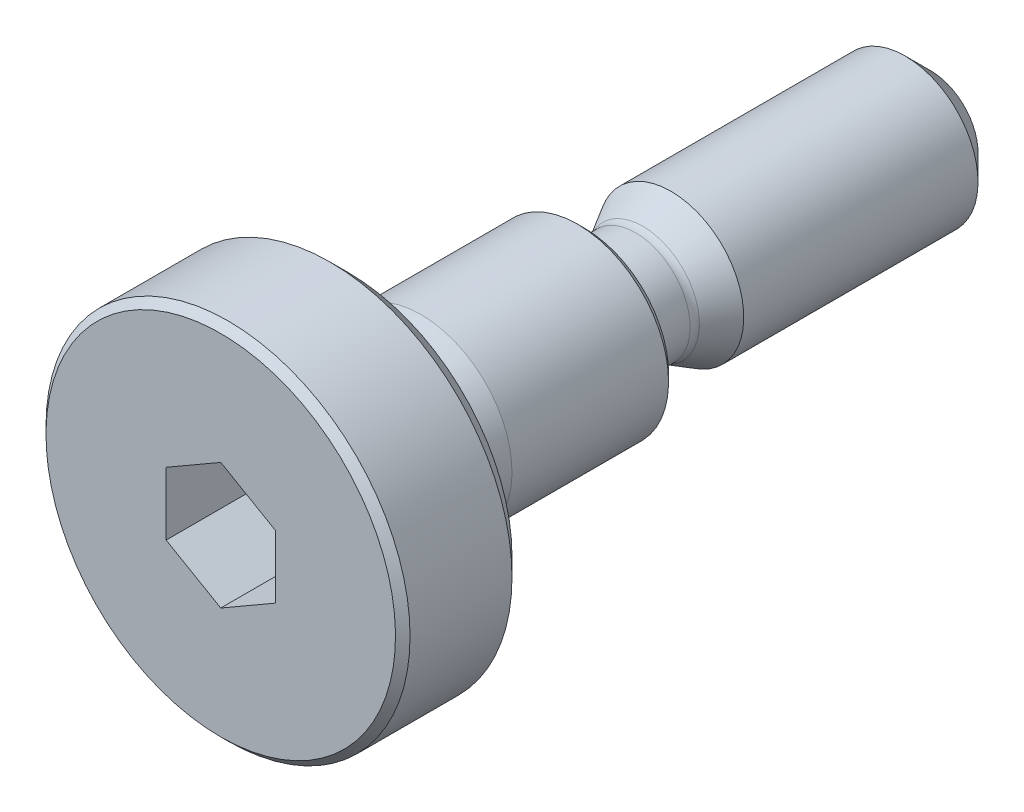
ISO-10303-21;
HEADER;
FILE_DESCRIPTION(('STEP AP214'),'2;1');
FILE_NAME('part.step','',(''),(''),'','','');
FILE_SCHEMA(('AUTOMOTIVE_DESIGN { 1 0 10303 214 1 1 1 1 }'));
ENDSEC;
DATA;
#1=APPLICATION_CONTEXT('core data for automotive mechanical design processes');
#2=APPLICATION_PROTOCOL_DEFINITION('international standard','automotive_design',2000,#1);
#3=PRODUCT_CONTEXT('',#1,'mechanical');
#4=PRODUCT('Part','Part','',(#3));
#5=PRODUCT_RELATED_PRODUCT_CATEGORY('part','',(#4));
#6=PRODUCT_DEFINITION_FORMATION('','',#4);
#7=PRODUCT_DEFINITION_CONTEXT('part definition',#1,'design');
#8=PRODUCT_DEFINITION('design','',#6,#7);
#9=PRODUCT_DEFINITION_SHAPE('','',#8);
#10=(LENGTH_UNIT() NAMED_UNIT(*) SI_UNIT(.MILLI.,.METRE.));
#11=(NAMED_UNIT(*) PLANE_ANGLE_UNIT() SI_UNIT($,.RADIAN.));
#12=(NAMED_UNIT(*) SI_UNIT($,.STERADIAN.) SOLID_ANGLE_UNIT());
#13=UNCERTAINTY_MEASURE_WITH_UNIT(LENGTH_MEASURE(1.E-05),#10,'distance_accuracy_value','');
#14=(GEOMETRIC_REPRESENTATION_CONTEXT(3) GLOBAL_UNCERTAINTY_ASSIGNED_CONTEXT((#13)) GLOBAL_UNIT_ASSIGNED_CONTEXT((#10,
#11,#12)) REPRESENTATION_CONTEXT('',''));
#15=CARTESIAN_POINT('',(0.,0.,0.));
#16=DIRECTION('',(0.,0.,1.));
#17=DIRECTION('',(1.,0.,0.));
#18=AXIS2_PLACEMENT_3D('',#15,#16,#17);
#19=CARTESIAN_POINT('',(0.,0.,10.));
#20=DIRECTION('',(0.,0.,1.));
#21=DIRECTION('',(0.,-1.,0.));
#22=AXIS2_PLACEMENT_3D('',#19,#20,#21);
#23=PLANE('',#22);
#24=DIRECTION('',(-0.866025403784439,0.5,0.));
#25=VECTOR('',#24,1.);
#26=CARTESIAN_POINT('',(1.5,0.86602540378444,10.));
#27=LINE('',#26,#25);
#28=CARTESIAN_POINT('',(1.5,0.86602540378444,10.));
#29=VERTEX_POINT('',#28);
#30=CARTESIAN_POINT('',(0.,1.73205080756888,10.));
#31=VERTEX_POINT('',#30);
#32=EDGE_CURVE('E29',#29,#31,#27,.T.);
#33=ORIENTED_EDGE('',*,*,#32,.F.);
#34=DIRECTION('',(0.,1.,0.));
#35=VECTOR('',#34,1.);
#36=CARTESIAN_POINT('',(1.5,-0.866025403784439,10.));
#37=LINE('',#36,#35);
#38=CARTESIAN_POINT('',(1.5,-0.866025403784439,10.));
#39=VERTEX_POINT('',#38);
#40=EDGE_CURVE('E112',#39,#29,#37,.T.);
#41=ORIENTED_EDGE('',*,*,#40,.F.);
#42=DIRECTION('',(0.866025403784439,0.5,0.));
#43=VECTOR('',#42,1.);
#44=CARTESIAN_POINT('',(0.,-1.73205080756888,10.));
#45=LINE('',#44,#43);
#46=CARTESIAN_POINT('',(0.,-1.73205080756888,10.));
#47=VERTEX_POINT('',#46);
#48=EDGE_CURVE('E110',#47,#39,#45,.T.);
#49=ORIENTED_EDGE('',*,*,#48,.F.);
#50=DIRECTION('',(0.866025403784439,-0.5,0.));
#51=VECTOR('',#50,1.);
#52=CARTESIAN_POINT('',(-1.5,-0.866025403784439,10.));
#53=LINE('',#52,#51);
#54=CARTESIAN_POINT('',(-1.5,-0.866025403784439,10.));
#55=VERTEX_POINT('',#54);
#56=EDGE_CURVE('E77',#55,#47,#53,.T.);
#57=ORIENTED_EDGE('',*,*,#56,.F.);
#58=DIRECTION('',(0.,-1.,0.));
#59=VECTOR('',#58,1.);
#60=CARTESIAN_POINT('',(-1.5,0.866025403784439,10.));
#61=LINE('',#60,#59);
#62=CARTESIAN_POINT('',(-1.5,0.866025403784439,10.));
#63=VERTEX_POINT('',#62);
#64=EDGE_CURVE('E106',#63,#55,#61,.T.);
#65=ORIENTED_EDGE('',*,*,#64,.F.);
#66=DIRECTION('',(-0.866025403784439,-0.5,0.));
#67=VECTOR('',#66,1.);
#68=CARTESIAN_POINT('',(0.,1.73205080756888,10.));
#69=LINE('',#68,#67);
#70=EDGE_CURVE('E103',#31,#63,#69,.T.);
#71=ORIENTED_EDGE('',*,*,#70,.F.);
#72=EDGE_LOOP('',(#33,#41,#49,#57,#65,#71));
#73=FACE_BOUND('',#72,.T.);
#74=CARTESIAN_POINT('',(0.,0.,10.));
#75=DIRECTION('',(0.,0.,1.));
#76=DIRECTION('',(0.,-1.,0.));
#77=AXIS2_PLACEMENT_3D('',#74,#75,#76);
#78=CIRCLE('',#77,4.8);
#79=CARTESIAN_POINT('',(0.,-4.8,10.));
#80=VERTEX_POINT('',#79);
#81=EDGE_CURVE('E151',#80,#80,#78,.T.);
#82=ORIENTED_EDGE('',*,*,#81,.T.);
#83=EDGE_LOOP('',(#82));
#84=FACE_BOUND('',#83,.T.);
#85=ADVANCED_FACE('F14',(#73,#84),#23,.T.);
#86=CARTESIAN_POINT('',(0.,0.,-9.5));
#87=DIRECTION('',(0.,0.,-1.));
#88=DIRECTION('',(0.,1.,0.));
#89=AXIS2_PLACEMENT_3D('',#86,#87,#88);
#90=CYLINDRICAL_SURFACE('',#89,5.);
#91=CARTESIAN_POINT('',(0.,0.,7.));
#92=DIRECTION('',(0.,0.,-1.));
#93=DIRECTION('',(0.,1.,0.));
#94=AXIS2_PLACEMENT_3D('',#91,#92,#93);
#95=CIRCLE('',#94,5.);
#96=CARTESIAN_POINT('',(0.,5.,7.));
#97=VERTEX_POINT('',#96);
#98=EDGE_CURVE('E157',#97,#97,#95,.F.);
#99=ORIENTED_EDGE('',*,*,#98,.T.);
#100=EDGE_LOOP('',(#99));
#101=FACE_BOUND('',#100,.T.);
#102=CARTESIAN_POINT('',(0.,0.,9.8));
#103=DIRECTION('',(0.,0.,1.));
#104=DIRECTION('',(0.,-1.,0.));
#105=AXIS2_PLACEMENT_3D('',#102,#103,#104);
#106=CIRCLE('',#105,5.);
#107=CARTESIAN_POINT('',(0.,-5.,9.8));
#108=VERTEX_POINT('',#107);
#109=EDGE_CURVE('E148',#108,#108,#106,.F.);
#110=ORIENTED_EDGE('',*,*,#109,.T.);
#111=EDGE_LOOP('',(#110));
#112=FACE_BOUND('',#111,.T.);
#113=ADVANCED_FACE('F181',(#101,#112),#90,.T.);
#114=CARTESIAN_POINT('',(0.,5.,6.5));
#115=DIRECTION('',(0.,0.,-1.));
#116=DIRECTION('',(0.,1.,0.));
#117=AXIS2_PLACEMENT_3D('',#114,#115,#116);
#118=PLANE('',#117);
#119=CARTESIAN_POINT('',(0.,0.,6.5));
#120=DIRECTION('',(0.,0.,-1.));
#121=DIRECTION('',(0.,1.,0.));
#122=AXIS2_PLACEMENT_3D('',#119,#120,#121);
#123=CIRCLE('',#122,4.5);
#124=CARTESIAN_POINT('',(0.,4.5,6.5));
#125=VERTEX_POINT('',#124);
#126=EDGE_CURVE('E154',#125,#125,#123,.T.);
#127=ORIENTED_EDGE('',*,*,#126,.T.);
#128=EDGE_LOOP('',(#127));
#129=FACE_BOUND('',#128,.T.);
#130=CARTESIAN_POINT('',(0.,0.,6.5));
#131=DIRECTION('',(0.,0.,-1.));
#132=DIRECTION('',(0.,1.,0.));
#133=AXIS2_PLACEMENT_3D('',#130,#131,#132);
#134=CIRCLE('',#133,2.7);
#135=CARTESIAN_POINT('',(0.,2.7,6.5));
#136=VERTEX_POINT('',#135);
#137=EDGE_CURVE('E133',#136,#136,#134,.F.);
#138=ORIENTED_EDGE('',*,*,#137,.T.);
#139=EDGE_LOOP('',(#138));
#140=FACE_BOUND('',#139,.T.);
#141=ADVANCED_FACE('F188',(#129,#140),#118,.T.);
#142=CARTESIAN_POINT('',(0.,0.,-9.5));
#143=DIRECTION('',(0.,0.,-1.));
#144=DIRECTION('',(0.,1.,0.));
#145=AXIS2_PLACEMENT_3D('',#142,#143,#144);
#146=CYLINDRICAL_SURFACE('',#145,2.3);
#147=CARTESIAN_POINT('',(0.,0.,6.1));
#148=DIRECTION('',(0.,0.,-1.));
#149=DIRECTION('',(0.,1.,0.));
#150=AXIS2_PLACEMENT_3D('',#147,#148,#149);
#151=CIRCLE('',#150,2.3);
#152=CARTESIAN_POINT('',(0.,2.3,6.1));
#153=VERTEX_POINT('',#152);
#154=EDGE_CURVE('E130',#153,#153,#151,.T.);
#155=ORIENTED_EDGE('',*,*,#154,.T.);
#156=EDGE_LOOP('',(#155));
#157=FACE_BOUND('',#156,.T.);
#158=CARTESIAN_POINT('',(0.,0.,5.5));
#159=DIRECTION('',(0.,0.,-1.));
#160=DIRECTION('',(0.,1.,0.));
#161=AXIS2_PLACEMENT_3D('',#158,#159,#160);
#162=CIRCLE('',#161,2.3);
#163=CARTESIAN_POINT('',(0.,2.3,5.5));
#164=VERTEX_POINT('',#163);
#165=EDGE_CURVE('E127',#164,#164,#162,.T.);
#166=ORIENTED_EDGE('',*,*,#165,.F.);
#167=EDGE_LOOP('',(#166));
#168=FACE_BOUND('',#167,.T.);
#169=ADVANCED_FACE('F256',(#157,#168),#146,.T.);
#170=CARTESIAN_POINT('',(0.,0.,4.5));
#171=DIRECTION('',(0.,0.,-1.));
#172=DIRECTION('',(0.,1.,0.));
#173=AXIS2_PLACEMENT_3D('',#170,#171,#172);
#174=CONICAL_SURFACE('',#173,2.5,0.197395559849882);
#175=ORIENTED_EDGE('',*,*,#165,.T.);
#176=EDGE_LOOP('',(#175));
#177=FACE_BOUND('',#176,.T.);
#178=CARTESIAN_POINT('',(0.,0.,4.5));
#179=DIRECTION('',(0.,0.,-1.));
#180=DIRECTION('',(0.,1.,0.));
#181=AXIS2_PLACEMENT_3D('',#178,#179,#180);
#182=CIRCLE('',#181,2.5);
#183=CARTESIAN_POINT('',(0.,2.5,4.5));
#184=VERTEX_POINT('',#183);
#185=EDGE_CURVE('E124',#184,#184,#182,.T.);
#186=ORIENTED_EDGE('',*,*,#185,.F.);
#187=EDGE_LOOP('',(#186));
#188=FACE_BOUND('',#187,.T.);
#189=ADVANCED_FACE('F252',(#177,#188),#174,.T.);
#190=CARTESIAN_POINT('',(0.,0.,-9.5));
#191=DIRECTION('',(0.,0.,-1.));
#192=DIRECTION('',(0.,1.,0.));
#193=AXIS2_PLACEMENT_3D('',#190,#191,#192);
#194=CYLINDRICAL_SURFACE('',#193,2.5);
#195=CARTESIAN_POINT('',(0.,0.,0.2));
#196=DIRECTION('',(0.,0.,-1.));
#197=DIRECTION('',(0.,1.,0.));
#198=AXIS2_PLACEMENT_3D('',#195,#196,#197);
#199=CIRCLE('',#198,2.5);
#200=CARTESIAN_POINT('',(0.,2.5,0.2));
#201=VERTEX_POINT('',#200);
#202=EDGE_CURVE('E163',#201,#201,#199,.F.);
#203=ORIENTED_EDGE('',*,*,#202,.T.);
#204=EDGE_LOOP('',(#203));
#205=FACE_BOUND('',#204,.T.);
#206=ORIENTED_EDGE('',*,*,#185,.T.);
#207=EDGE_LOOP('',(#206));
#208=FACE_BOUND('',#207,.T.);
#209=ADVANCED_FACE('F231',(#205,#208),#194,.T.);
#210=CARTESIAN_POINT('',(0.,2.5,0.));
#211=DIRECTION('',(0.,0.,-1.));
#212=DIRECTION('',(0.,1.,0.));
#213=AXIS2_PLACEMENT_3D('',#210,#211,#212);
#214=PLANE('',#213);
#215=CARTESIAN_POINT('',(0.,0.,0.));
#216=DIRECTION('',(0.,0.,-1.));
#217=DIRECTION('',(0.,1.,0.));
#218=AXIS2_PLACEMENT_3D('',#215,#216,#217);
#219=CIRCLE('',#218,2.3);
#220=CARTESIAN_POINT('',(0.,2.3,0.));
#221=VERTEX_POINT('',#220);
#222=EDGE_CURVE('E160',#221,#221,#219,.T.);
#223=ORIENTED_EDGE('',*,*,#222,.T.);
#224=EDGE_LOOP('',(#223));
#225=FACE_BOUND('',#224,.T.);
#226=CARTESIAN_POINT('',(0.,0.,0.));
#227=DIRECTION('',(0.,0.,-1.));
#228=DIRECTION('',(0.,1.,0.));
#229=AXIS2_PLACEMENT_3D('',#226,#227,#228);
#230=CIRCLE('',#229,1.9);
#231=CARTESIAN_POINT('',(0.,1.9,0.));
#232=VERTEX_POINT('',#231);
#233=EDGE_CURVE('E145',#232,#232,#230,.F.);
#234=ORIENTED_EDGE('',*,*,#233,.T.);
#235=EDGE_LOOP('',(#234));
#236=FACE_BOUND('',#235,.T.);
#237=ADVANCED_FACE('F227',(#225,#236),#214,.T.);
#238=CARTESIAN_POINT('',(0.,0.,-9.5));
#239=DIRECTION('',(0.,0.,-1.));
#240=DIRECTION('',(0.,1.,0.));
#241=AXIS2_PLACEMENT_3D('',#238,#239,#240);
#242=CYLINDRICAL_SURFACE('',#241,1.5);
#243=CARTESIAN_POINT('',(0.,0.,-1.39282032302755));
#244=DIRECTION('',(0.,0.,-1.));
#245=DIRECTION('',(0.,1.,0.));
#246=AXIS2_PLACEMENT_3D('',#243,#244,#245);
#247=CIRCLE('',#246,1.5);
#248=CARTESIAN_POINT('',(0.,1.5,-1.39282032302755));
#249=VERTEX_POINT('',#248);
#250=EDGE_CURVE('E142',#249,#249,#247,.F.);
#251=ORIENTED_EDGE('',*,*,#250,.T.);
#252=EDGE_LOOP('',(#251));
#253=FACE_BOUND('',#252,.T.);
#254=CARTESIAN_POINT('',(0.,0.,-0.4));
#255=DIRECTION('',(0.,0.,-1.));
#256=DIRECTION('',(0.,1.,0.));
#257=AXIS2_PLACEMENT_3D('',#254,#255,#256);
#258=CIRCLE('',#257,1.5);
#259=CARTESIAN_POINT('',(0.,1.5,-0.4));
#260=VERTEX_POINT('',#259);
#261=EDGE_CURVE('E139',#260,#260,#258,.T.);
#262=ORIENTED_EDGE('',*,*,#261,.T.);
#263=EDGE_LOOP('',(#262));
#264=FACE_BOUND('',#263,.T.);
#265=ADVANCED_FACE('F230',(#253,#264),#242,.T.);
#266=CARTESIAN_POINT('',(0.,0.,-2.36602540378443));
#267=DIRECTION('',(0.,0.,-1.));
#268=DIRECTION('',(0.,1.,0.));
#269=AXIS2_PLACEMENT_3D('',#266,#267,#268);
#270=CONICAL_SURFACE('',#269,2.,0.523598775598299);
#271=CARTESIAN_POINT('',(0.,0.,-1.59282032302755));
#272=DIRECTION('',(0.,0.,-1.));
#273=DIRECTION('',(0.,1.,0.));
#274=AXIS2_PLACEMENT_3D('',#271,#272,#273);
#275=CIRCLE('',#274,1.55358983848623);
#276=CARTESIAN_POINT('',(0.,1.55358983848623,-1.59282032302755));
#277=VERTEX_POINT('',#276);
#278=EDGE_CURVE('E136',#277,#277,#275,.T.);
#279=ORIENTED_EDGE('',*,*,#278,.T.);
#280=EDGE_LOOP('',(#279));
#281=FACE_BOUND('',#280,.T.);
#282=CARTESIAN_POINT('',(0.,0.,-2.36602540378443));
#283=DIRECTION('',(0.,0.,-1.));
#284=DIRECTION('',(0.,1.,0.));
#285=AXIS2_PLACEMENT_3D('',#282,#283,#284);
#286=CIRCLE('',#285,2.);
#287=CARTESIAN_POINT('',(0.,2.,-2.36602540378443));
#288=VERTEX_POINT('',#287);
#289=EDGE_CURVE('E116',#288,#288,#286,.T.);
#290=ORIENTED_EDGE('',*,*,#289,.F.);
#291=EDGE_LOOP('',(#290));
#292=FACE_BOUND('',#291,.T.);
#293=ADVANCED_FACE('F238',(#281,#292),#270,.T.);
#294=CARTESIAN_POINT('',(0.,0.,-9.5));
#295=DIRECTION('',(0.,0.,-1.));
#296=DIRECTION('',(0.,1.,0.));
#297=AXIS2_PLACEMENT_3D('',#294,#295,#296);
#298=CYLINDRICAL_SURFACE('',#297,2.);
#299=CARTESIAN_POINT('',(0.,0.,-8.8));
#300=DIRECTION('',(0.,0.,-1.));
#301=DIRECTION('',(0.,1.,0.));
#302=AXIS2_PLACEMENT_3D('',#299,#300,#301);
#303=CIRCLE('',#302,2.);
#304=CARTESIAN_POINT('',(0.,2.,-8.8));
#305=VERTEX_POINT('',#304);
#306=EDGE_CURVE('E9',#305,#305,#303,.F.);
#307=ORIENTED_EDGE('',*,*,#306,.T.);
#308=EDGE_LOOP('',(#307));
#309=FACE_BOUND('',#308,.T.);
#310=ORIENTED_EDGE('',*,*,#289,.T.);
#311=EDGE_LOOP('',(#310));
#312=FACE_BOUND('',#311,.T.);
#313=ADVANCED_FACE('F245',(#309,#312),#298,.T.);
#314=CARTESIAN_POINT('',(0.,2.,-9.5));
#315=DIRECTION('',(0.,0.,-1.));
#316=DIRECTION('',(0.,1.,0.));
#317=AXIS2_PLACEMENT_3D('',#314,#315,#316);
#318=PLANE('',#317);
#319=CARTESIAN_POINT('',(0.,0.,-9.5));
#320=DIRECTION('',(0.,0.,-1.));
#321=DIRECTION('',(0.,1.,0.));
#322=AXIS2_PLACEMENT_3D('',#319,#320,#321);
#323=CIRCLE('',#322,1.3);
#324=CARTESIAN_POINT('',(0.,1.3,-9.5));
#325=VERTEX_POINT('',#324);
#326=EDGE_CURVE('E22',#325,#325,#323,.T.);
#327=ORIENTED_EDGE('',*,*,#326,.T.);
#328=EDGE_LOOP('',(#327));
#329=FACE_BOUND('',#328,.T.);
#330=ADVANCED_FACE('F168',(#329),#318,.T.);
#331=CARTESIAN_POINT('',(0.,0.,6.1));
#332=DIRECTION('',(0.,0.,-1.));
#333=DIRECTION('',(0.,1.,0.));
#334=AXIS2_PLACEMENT_3D('',#331,#332,#333);
#335=TOROIDAL_SURFACE('',#334,2.7,0.4);
#336=ORIENTED_EDGE('',*,*,#137,.F.);
#337=EDGE_LOOP('',(#336));
#338=FACE_BOUND('',#337,.T.);
#339=ORIENTED_EDGE('',*,*,#154,.F.);
#340=EDGE_LOOP('',(#339));
#341=FACE_BOUND('',#340,.T.);
#342=ADVANCED_FACE('F194',(#338,#341),#335,.F.);
#343=CARTESIAN_POINT('',(0.,0.,-1.39282032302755));
#344=DIRECTION('',(0.,0.,-1.));
#345=DIRECTION('',(0.,1.,0.));
#346=AXIS2_PLACEMENT_3D('',#343,#344,#345);
#347=TOROIDAL_SURFACE('',#346,1.9,0.4);
#348=ORIENTED_EDGE('',*,*,#250,.F.);
#349=EDGE_LOOP('',(#348));
#350=FACE_BOUND('',#349,.T.);
#351=ORIENTED_EDGE('',*,*,#278,.F.);
#352=EDGE_LOOP('',(#351));
#353=FACE_BOUND('',#352,.T.);
#354=ADVANCED_FACE('F197',(#350,#353),#347,.F.);
#355=CARTESIAN_POINT('',(0.,0.,-0.4));
#356=DIRECTION('',(0.,0.,-1.));
#357=DIRECTION('',(0.,1.,0.));
#358=AXIS2_PLACEMENT_3D('',#355,#356,#357);
#359=TOROIDAL_SURFACE('',#358,1.9,0.4);
#360=ORIENTED_EDGE('',*,*,#233,.F.);
#361=EDGE_LOOP('',(#360));
#362=FACE_BOUND('',#361,.T.);
#363=ORIENTED_EDGE('',*,*,#261,.F.);
#364=EDGE_LOOP('',(#363));
#365=FACE_BOUND('',#364,.T.);
#366=ADVANCED_FACE('F201',(#362,#365),#359,.F.);
#367=CARTESIAN_POINT('',(0.,0.,9.8));
#368=DIRECTION('',(0.,0.,-1.));
#369=DIRECTION('',(0.,1.,0.));
#370=AXIS2_PLACEMENT_3D('',#367,#368,#369);
#371=CONICAL_SURFACE('',#370,5.,0.785398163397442);
#372=ORIENTED_EDGE('',*,*,#81,.F.);
#373=EDGE_LOOP('',(#372));
#374=FACE_BOUND('',#373,.T.);
#375=ORIENTED_EDGE('',*,*,#109,.F.);
#376=EDGE_LOOP('',(#375));
#377=FACE_BOUND('',#376,.T.);
#378=ADVANCED_FACE('F205',(#374,#377),#371,.T.);
#379=CARTESIAN_POINT('',(0.,0.,6.5));
#380=DIRECTION('',(0.,0.,1.));
#381=DIRECTION('',(0.,-1.,0.));
#382=AXIS2_PLACEMENT_3D('',#379,#380,#381);
#383=CONICAL_SURFACE('',#382,4.5,0.785398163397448);
#384=ORIENTED_EDGE('',*,*,#98,.F.);
#385=EDGE_LOOP('',(#384));
#386=FACE_BOUND('',#385,.T.);
#387=ORIENTED_EDGE('',*,*,#126,.F.);
#388=EDGE_LOOP('',(#387));
#389=FACE_BOUND('',#388,.T.);
#390=ADVANCED_FACE('F209',(#386,#389),#383,.T.);
#391=CARTESIAN_POINT('',(0.,0.,0.));
#392=DIRECTION('',(0.,0.,1.));
#393=DIRECTION('',(0.,-1.,0.));
#394=AXIS2_PLACEMENT_3D('',#391,#392,#393);
#395=CONICAL_SURFACE('',#394,2.3,0.785398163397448);
#396=ORIENTED_EDGE('',*,*,#202,.F.);
#397=EDGE_LOOP('',(#396));
#398=FACE_BOUND('',#397,.T.);
#399=ORIENTED_EDGE('',*,*,#222,.F.);
#400=EDGE_LOOP('',(#399));
#401=FACE_BOUND('',#400,.T.);
#402=ADVANCED_FACE('F212',(#398,#401),#395,.T.);
#403=CARTESIAN_POINT('',(1.5,0.86602540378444,4.5));
#404=DIRECTION('',(0.5,0.866025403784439,0.));
#405=DIRECTION('',(0.866025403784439,-0.5,0.));
#406=AXIS2_PLACEMENT_3D('',#403,#404,#405);
#407=PLANE('',#406);
#408=ORIENTED_EDGE('',*,*,#32,.T.);
#409=DIRECTION('',(0.,0.,1.));
#410=VECTOR('',#409,1.);
#411=CARTESIAN_POINT('',(0.,1.73205080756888,4.5));
#412=LINE('',#411,#410);
#413=CARTESIAN_POINT('',(0.,1.73205080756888,4.5));
#414=VERTEX_POINT('',#413);
#415=EDGE_CURVE('E59',#414,#31,#412,.T.);
#416=ORIENTED_EDGE('',*,*,#415,.F.);
#417=DIRECTION('',(-0.866025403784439,0.5,0.));
#418=VECTOR('',#417,1.);
#419=CARTESIAN_POINT('',(1.5,0.86602540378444,4.5));
#420=LINE('',#419,#418);
#421=CARTESIAN_POINT('',(1.5,0.86602540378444,4.5));
#422=VERTEX_POINT('',#421);
#423=EDGE_CURVE('E114',#422,#414,#420,.T.);
#424=ORIENTED_EDGE('',*,*,#423,.F.);
#425=DIRECTION('',(0.,0.,1.));
#426=VECTOR('',#425,1.);
#427=CARTESIAN_POINT('',(1.5,0.86602540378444,4.5));
#428=LINE('',#427,#426);
#429=EDGE_CURVE('E37',#422,#29,#428,.T.);
#430=ORIENTED_EDGE('',*,*,#429,.T.);
#431=EDGE_LOOP('',(#408,#416,#424,#430));
#432=FACE_BOUND('',#431,.T.);
#433=ADVANCED_FACE('F215',(#432),#407,.F.);
#434=CARTESIAN_POINT('',(1.5,-0.866025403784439,4.5));
#435=DIRECTION('',(1.,0.,0.));
#436=DIRECTION('',(0.,0.,-1.));
#437=AXIS2_PLACEMENT_3D('',#434,#435,#436);
#438=PLANE('',#437);
#439=ORIENTED_EDGE('',*,*,#40,.T.);
#440=ORIENTED_EDGE('',*,*,#429,.F.);
#441=DIRECTION('',(0.,1.,0.));
#442=VECTOR('',#441,1.);
#443=CARTESIAN_POINT('',(1.5,-0.866025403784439,4.5));
#444=LINE('',#443,#442);
#445=CARTESIAN_POINT('',(1.5,-0.866025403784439,4.5));
#446=VERTEX_POINT('',#445);
#447=EDGE_CURVE('E89',#446,#422,#444,.T.);
#448=ORIENTED_EDGE('',*,*,#447,.F.);
#449=DIRECTION('',(0.,0.,1.));
#450=VECTOR('',#449,1.);
#451=CARTESIAN_POINT('',(1.5,-0.866025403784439,4.5));
#452=LINE('',#451,#450);
#453=EDGE_CURVE('E81',#446,#39,#452,.T.);
#454=ORIENTED_EDGE('',*,*,#453,.T.);
#455=EDGE_LOOP('',(#439,#440,#448,#454));
#456=FACE_BOUND('',#455,.T.);
#457=ADVANCED_FACE('F221',(#456),#438,.F.);
#458=CARTESIAN_POINT('',(0.,-1.73205080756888,4.5));
#459=DIRECTION('',(0.5,-0.866025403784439,0.));
#460=DIRECTION('',(-0.866025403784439,-0.5,0.));
#461=AXIS2_PLACEMENT_3D('',#458,#459,#460);
#462=PLANE('',#461);
#463=ORIENTED_EDGE('',*,*,#48,.T.);
#464=ORIENTED_EDGE('',*,*,#453,.F.);
#465=DIRECTION('',(0.866025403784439,0.5,0.));
#466=VECTOR('',#465,1.);
#467=CARTESIAN_POINT('',(0.,-1.73205080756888,4.5));
#468=LINE('',#467,#466);
#469=CARTESIAN_POINT('',(0.,-1.73205080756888,4.5));
#470=VERTEX_POINT('',#469);
#471=EDGE_CURVE('E85',#470,#446,#468,.T.);
#472=ORIENTED_EDGE('',*,*,#471,.F.);
#473=DIRECTION('',(0.,0.,1.));
#474=VECTOR('',#473,1.);
#475=CARTESIAN_POINT('',(0.,-1.73205080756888,4.5));
#476=LINE('',#475,#474);
#477=EDGE_CURVE('E70',#470,#47,#476,.T.);
#478=ORIENTED_EDGE('',*,*,#477,.T.);
#479=EDGE_LOOP('',(#463,#464,#472,#478));
#480=FACE_BOUND('',#479,.T.);
#481=ADVANCED_FACE('F86',(#480),#462,.F.);
#482=CARTESIAN_POINT('',(-1.5,-0.866025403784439,4.5));
#483=DIRECTION('',(-0.5,-0.866025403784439,0.));
#484=DIRECTION('',(-0.866025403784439,0.5,0.));
#485=AXIS2_PLACEMENT_3D('',#482,#483,#484);
#486=PLANE('',#485);
#487=ORIENTED_EDGE('',*,*,#56,.T.);
#488=ORIENTED_EDGE('',*,*,#477,.F.);
#489=DIRECTION('',(0.866025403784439,-0.5,0.));
#490=VECTOR('',#489,1.);
#491=CARTESIAN_POINT('',(-1.5,-0.866025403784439,4.5));
#492=LINE('',#491,#490);
#493=CARTESIAN_POINT('',(-1.5,-0.866025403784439,4.5));
#494=VERTEX_POINT('',#493);
#495=EDGE_CURVE('E74',#494,#470,#492,.T.);
#496=ORIENTED_EDGE('',*,*,#495,.F.);
#497=DIRECTION('',(0.,0.,1.));
#498=VECTOR('',#497,1.);
#499=CARTESIAN_POINT('',(-1.5,-0.866025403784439,4.5));
#500=LINE('',#499,#498);
#501=EDGE_CURVE('E82',#494,#55,#500,.T.);
#502=ORIENTED_EDGE('',*,*,#501,.T.);
#503=EDGE_LOOP('',(#487,#488,#496,#502));
#504=FACE_BOUND('',#503,.T.);
#505=ADVANCED_FACE('F72',(#504),#486,.F.);
#506=CARTESIAN_POINT('',(-1.5,0.866025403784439,4.5));
#507=DIRECTION('',(-1.,0.,0.));
#508=DIRECTION('',(0.,1.,0.));
#509=AXIS2_PLACEMENT_3D('',#506,#507,#508);
#510=PLANE('',#509);
#511=ORIENTED_EDGE('',*,*,#64,.T.);
#512=ORIENTED_EDGE('',*,*,#501,.F.);
#513=DIRECTION('',(0.,-1.,0.));
#514=VECTOR('',#513,1.);
#515=CARTESIAN_POINT('',(-1.5,0.866025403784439,4.5));
#516=LINE('',#515,#514);
#517=CARTESIAN_POINT('',(-1.5,0.866025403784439,4.5));
#518=VERTEX_POINT('',#517);
#519=EDGE_CURVE('E95',#518,#494,#516,.T.);
#520=ORIENTED_EDGE('',*,*,#519,.F.);
#521=DIRECTION('',(0.,0.,1.));
#522=VECTOR('',#521,1.);
#523=CARTESIAN_POINT('',(-1.5,0.866025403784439,4.5));
#524=LINE('',#523,#522);
#525=EDGE_CURVE('E119',#518,#63,#524,.T.);
#526=ORIENTED_EDGE('',*,*,#525,.T.);
#527=EDGE_LOOP('',(#511,#512,#520,#526));
#528=FACE_BOUND('',#527,.T.);
#529=ADVANCED_FACE('F382',(#528),#510,.F.);
#530=CARTESIAN_POINT('',(0.,1.73205080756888,4.5));
#531=DIRECTION('',(-0.5,0.866025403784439,0.));
#532=DIRECTION('',(0.866025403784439,0.5,0.));
#533=AXIS2_PLACEMENT_3D('',#530,#531,#532);
#534=PLANE('',#533);
#535=ORIENTED_EDGE('',*,*,#70,.T.);
#536=ORIENTED_EDGE('',*,*,#525,.F.);
#537=DIRECTION('',(-0.866025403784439,-0.5,0.));
#538=VECTOR('',#537,1.);
#539=CARTESIAN_POINT('',(0.,1.73205080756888,4.5));
#540=LINE('',#539,#538);
#541=EDGE_CURVE('E97',#414,#518,#540,.T.);
#542=ORIENTED_EDGE('',*,*,#541,.F.);
#543=ORIENTED_EDGE('',*,*,#415,.T.);
#544=EDGE_LOOP('',(#535,#536,#542,#543));
#545=FACE_BOUND('',#544,.T.);
#546=ADVANCED_FACE('F177',(#545),#534,.F.);
#547=CARTESIAN_POINT('',(0.,1.73205080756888,4.5));
#548=DIRECTION('',(0.,0.,1.));
#549=DIRECTION('',(1.,0.,0.));
#550=AXIS2_PLACEMENT_3D('',#547,#548,#549);
#551=PLANE('',#550);
#552=ORIENTED_EDGE('',*,*,#423,.T.);
#553=ORIENTED_EDGE('',*,*,#541,.T.);
#554=ORIENTED_EDGE('',*,*,#519,.T.);
#555=ORIENTED_EDGE('',*,*,#495,.T.);
#556=ORIENTED_EDGE('',*,*,#471,.T.);
#557=ORIENTED_EDGE('',*,*,#447,.T.);
#558=EDGE_LOOP('',(#552,#553,#554,#555,#556,#557));
#559=FACE_BOUND('',#558,.T.);
#560=ADVANCED_FACE('F92',(#559),#551,.T.);
#561=CARTESIAN_POINT('',(0.,0.,-9.5));
#562=DIRECTION('',(0.,0.,1.));
#563=DIRECTION('',(0.,-1.,0.));
#564=AXIS2_PLACEMENT_3D('',#561,#562,#563);
#565=CONICAL_SURFACE('',#564,1.3,0.785398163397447);
#566=ORIENTED_EDGE('',*,*,#306,.F.);
#567=EDGE_LOOP('',(#566));
#568=FACE_BOUND('',#567,.T.);
#569=ORIENTED_EDGE('',*,*,#326,.F.);
#570=EDGE_LOOP('',(#569));
#571=FACE_BOUND('',#570,.T.);
#572=ADVANCED_FACE('F16',(#568,#571),#565,.T.);
#573=CLOSED_SHELL('',(#85,#113,#141,#169,#189,#209,#237,#265,#293,#313,#330,#342,#354,#366,#378,
#390,#402,#433,#457,#481,#505,#529,#546,#560,#572));
#574=MANIFOLD_SOLID_BREP('B1',#573);
#575=ADVANCED_BREP_SHAPE_REPRESENTATION('',(#18,#574),#14);
#576=SHAPE_DEFINITION_REPRESENTATION(#9,#575);
ENDSEC;
END-ISO-10303-21;
